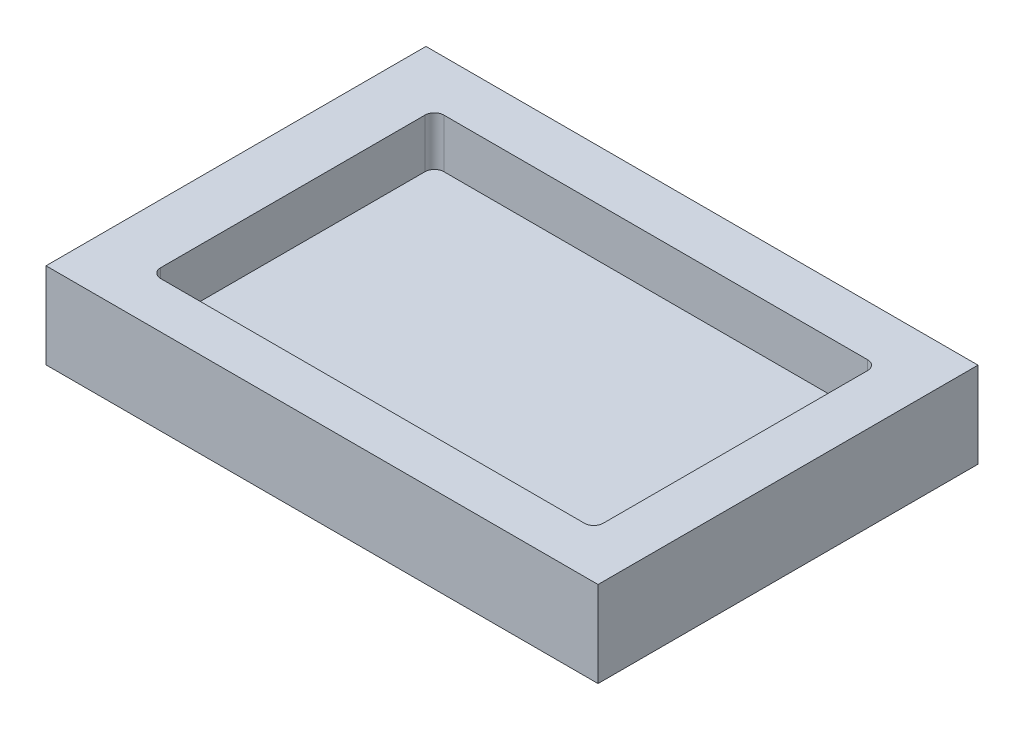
from build123d import *

# Parameters (mm, degrees)
SKETCH1_W          = 148.660788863
SKETCH1_H          = 102.318999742
EXTRUDE1_DEPTH     = 23.114
SKETCH2_W          = 119.189237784
SKETCH2_H          = 76.265782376
CUT_EXTRUDE1_DEPTH = 13.208
FILLET1_R          = 2.54


with BuildPart() as part:
    # Sketch1 → Extrude1 (new body)
    with BuildSketch(Plane(origin=(0, 0, 0), x_dir=(1, 0, 0), z_dir=(0, 1, 0))):
        with Locations((6.423614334, 3.670636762)):
            Rectangle(SKETCH1_W, SKETCH1_H)
    extrude(amount=EXTRUDE1_DEPTH)

    # Sketch2 → Cut-Extrude1 (cut)
    with BuildSketch(Plane(origin=(0, 23.114, 0), x_dir=(-1, 0, 0), z_dir=(0, 1, 0))):
        with Locations((-7.573349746, -3.095769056)):
            Rectangle(SKETCH2_W, SKETCH2_H)
    extrude(amount=-CUT_EXTRUDE1_DEPTH, mode=Mode.SUBTRACT)

    # Fillet1
    fillet1_edges = [part.edges().sort_by_distance(p)[0] for p in [
        (67.167968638, 16.51, -41.228660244),
        (67.167968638, 16.51, 35.037122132),
        (-52.021269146, 16.51, 35.037122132),
        (-52.021269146, 16.51, -41.228660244),
    ]]
    fillet(fillet1_edges, radius=FILLET1_R)


solid = part.part
